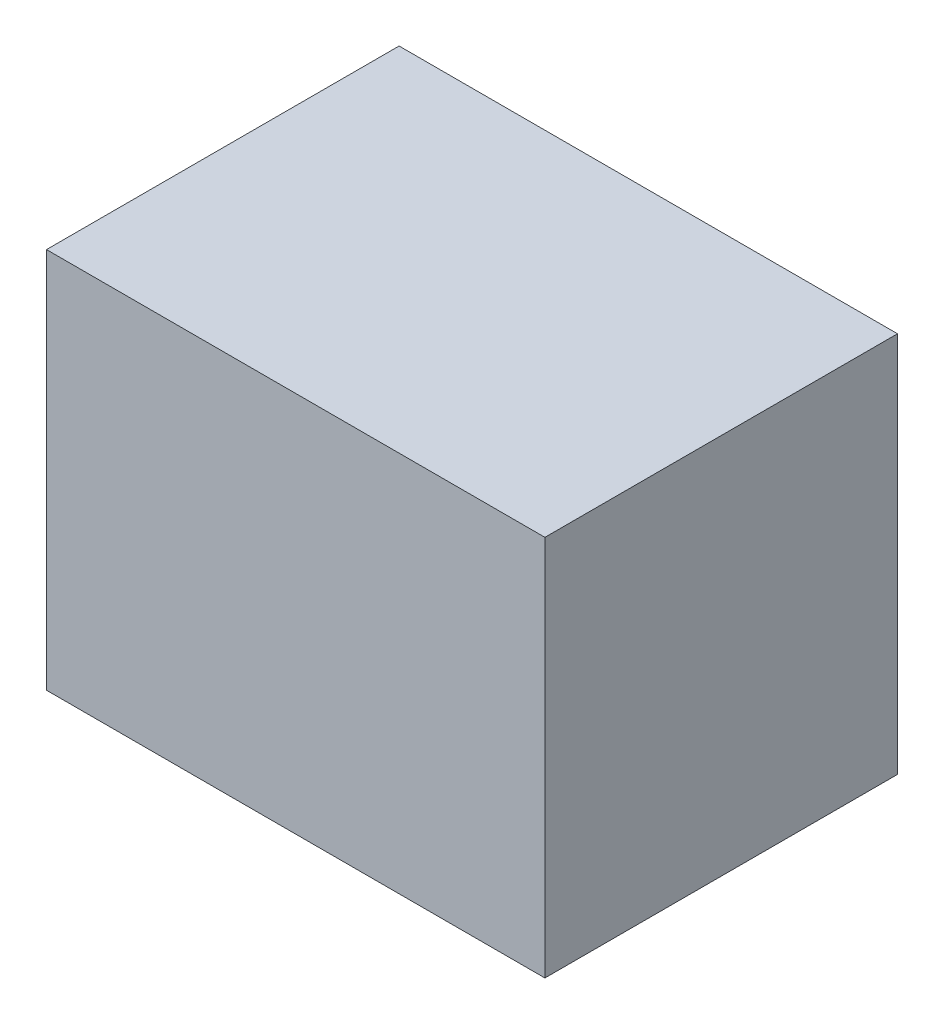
from build123d import *

# Parameters (mm, degrees)
SKETCH1_W           = 166.18862505
SKETCH1_H           = 117.56930693
BOSS_EXTRUDE1_DEPTH = 127.254
SHELL1_T            = 2.54


with BuildPart() as part:
    # Sketch1 → Boss-Extrude1 (new body)
    with BuildSketch(Plane(origin=(0, 0, 0), x_dir=(1, 0, 0), z_dir=(0, 1, 0))):
        Rectangle(SKETCH1_W, SKETCH1_H)
    extrude(amount=BOSS_EXTRUDE1_DEPTH)

    # Shell1 (no face opened: a closed hollow body)
    add(offset(amount=-SHELL1_T, mode=Mode.PRIVATE), mode=Mode.SUBTRACT)


solid = part.part
